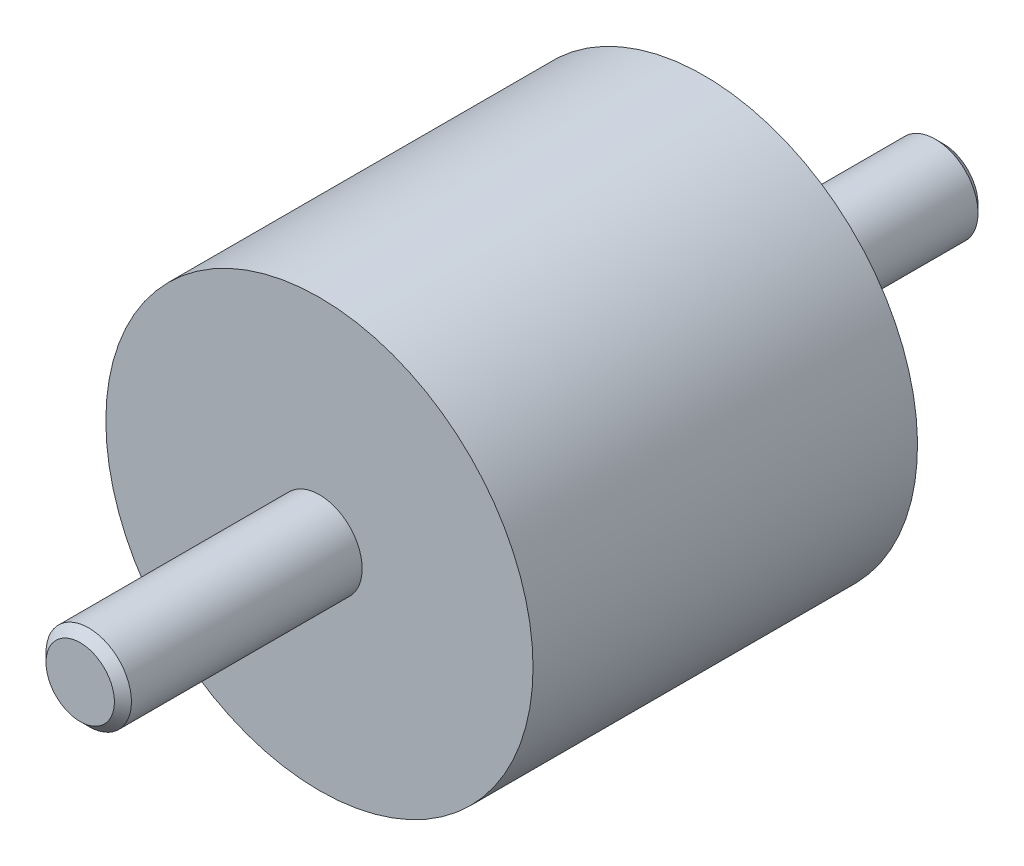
ISO-10303-21;
HEADER;
FILE_DESCRIPTION(('STEP AP214'),'2;1');
FILE_NAME('part.step','',(''),(''),'','','');
FILE_SCHEMA(('AUTOMOTIVE_DESIGN { 1 0 10303 214 1 1 1 1 }'));
ENDSEC;
DATA;
#1=APPLICATION_CONTEXT('core data for automotive mechanical design processes');
#2=APPLICATION_PROTOCOL_DEFINITION('international standard','automotive_design',2000,#1);
#3=PRODUCT_CONTEXT('',#1,'mechanical');
#4=PRODUCT('Part','Part','',(#3));
#5=PRODUCT_RELATED_PRODUCT_CATEGORY('part','',(#4));
#6=PRODUCT_DEFINITION_FORMATION('','',#4);
#7=PRODUCT_DEFINITION_CONTEXT('part definition',#1,'design');
#8=PRODUCT_DEFINITION('design','',#6,#7);
#9=PRODUCT_DEFINITION_SHAPE('','',#8);
#10=(LENGTH_UNIT() NAMED_UNIT(*) SI_UNIT(.MILLI.,.METRE.));
#11=(NAMED_UNIT(*) PLANE_ANGLE_UNIT() SI_UNIT($,.RADIAN.));
#12=(NAMED_UNIT(*) SI_UNIT($,.STERADIAN.) SOLID_ANGLE_UNIT());
#13=UNCERTAINTY_MEASURE_WITH_UNIT(LENGTH_MEASURE(1.E-05),#10,'distance_accuracy_value','');
#14=(GEOMETRIC_REPRESENTATION_CONTEXT(3) GLOBAL_UNCERTAINTY_ASSIGNED_CONTEXT((#13)) GLOBAL_UNIT_ASSIGNED_CONTEXT((#10,
#11,#12)) REPRESENTATION_CONTEXT('',''));
#15=CARTESIAN_POINT('',(0.,0.,0.));
#16=DIRECTION('',(0.,0.,1.));
#17=DIRECTION('',(1.,0.,0.));
#18=AXIS2_PLACEMENT_3D('',#15,#16,#17);
#19=CARTESIAN_POINT('',(0.,0.,0.66666666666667));
#20=DIRECTION('',(0.,0.,1.));
#21=DIRECTION('',(0.,-1.,0.));
#22=AXIS2_PLACEMENT_3D('',#19,#20,#21);
#23=CYLINDRICAL_SURFACE('',#22,25.);
#24=CARTESIAN_POINT('',(0.,0.,0.));
#25=DIRECTION('',(0.,0.,1.));
#26=DIRECTION('',(0.,-1.,0.));
#27=AXIS2_PLACEMENT_3D('',#24,#25,#26);
#28=CIRCLE('',#27,25.);
#29=CARTESIAN_POINT('',(0.,-25.,0.));
#30=VERTEX_POINT('',#29);
#31=EDGE_CURVE('E22',#30,#30,#28,.T.);
#32=ORIENTED_EDGE('',*,*,#31,.T.);
#33=EDGE_LOOP('',(#32));
#34=FACE_BOUND('',#33,.T.);
#35=CARTESIAN_POINT('',(0.,0.,45.));
#36=DIRECTION('',(0.,0.,-1.));
#37=DIRECTION('',(-1.,0.,0.));
#38=AXIS2_PLACEMENT_3D('',#35,#36,#37);
#39=CIRCLE('',#38,25.);
#40=CARTESIAN_POINT('',(-25.,0.,45.));
#41=VERTEX_POINT('',#40);
#42=EDGE_CURVE('E34',#41,#41,#39,.T.);
#43=ORIENTED_EDGE('',*,*,#42,.T.);
#44=EDGE_LOOP('',(#43));
#45=FACE_BOUND('',#44,.T.);
#46=ADVANCED_FACE('F12',(#34,#45),#23,.T.);
#47=CARTESIAN_POINT('',(25.,0.,0.));
#48=DIRECTION('',(0.,0.,-1.));
#49=DIRECTION('',(0.,1.,0.));
#50=AXIS2_PLACEMENT_3D('',#47,#48,#49);
#51=PLANE('',#50);
#52=CARTESIAN_POINT('',(0.,0.,0.));
#53=DIRECTION('',(0.,0.,-1.));
#54=DIRECTION('',(0.,1.,0.));
#55=AXIS2_PLACEMENT_3D('',#52,#53,#54);
#56=CIRCLE('',#55,5.);
#57=CARTESIAN_POINT('',(0.,5.,0.));
#58=VERTEX_POINT('',#57);
#59=EDGE_CURVE('E18',#58,#58,#56,.T.);
#60=ORIENTED_EDGE('',*,*,#59,.F.);
#61=EDGE_LOOP('',(#60));
#62=FACE_BOUND('',#61,.T.);
#63=ORIENTED_EDGE('',*,*,#31,.F.);
#64=EDGE_LOOP('',(#63));
#65=FACE_BOUND('',#64,.T.);
#66=ADVANCED_FACE('F57',(#62,#65),#51,.T.);
#67=CARTESIAN_POINT('',(0.,0.,-28.));
#68=DIRECTION('',(0.,0.,1.));
#69=DIRECTION('',(0.,-1.,0.));
#70=AXIS2_PLACEMENT_3D('',#67,#68,#69);
#71=CYLINDRICAL_SURFACE('',#70,5.);
#72=CARTESIAN_POINT('',(0.,0.,-27.08));
#73=DIRECTION('',(0.,0.,1.));
#74=DIRECTION('',(0.,-1.,0.));
#75=AXIS2_PLACEMENT_3D('',#72,#73,#74);
#76=CIRCLE('',#75,5.);
#77=CARTESIAN_POINT('',(0.,-5.,-27.08));
#78=VERTEX_POINT('',#77);
#79=EDGE_CURVE('E26',#78,#78,#76,.T.);
#80=ORIENTED_EDGE('',*,*,#79,.T.);
#81=EDGE_LOOP('',(#80));
#82=FACE_BOUND('',#81,.T.);
#83=ORIENTED_EDGE('',*,*,#59,.T.);
#84=EDGE_LOOP('',(#83));
#85=FACE_BOUND('',#84,.T.);
#86=ADVANCED_FACE('F62',(#82,#85),#71,.T.);
#87=CARTESIAN_POINT('',(0.,0.,-27.08));
#88=DIRECTION('',(0.,0.,1.));
#89=DIRECTION('',(0.,-1.,0.));
#90=AXIS2_PLACEMENT_3D('',#87,#88,#89);
#91=CONICAL_SURFACE('',#90,5.,0.785398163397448);
#92=CARTESIAN_POINT('',(0.,0.,-28.));
#93=DIRECTION('',(0.,0.,1.));
#94=DIRECTION('',(0.,-1.,0.));
#95=AXIS2_PLACEMENT_3D('',#92,#93,#94);
#96=CIRCLE('',#95,4.08);
#97=CARTESIAN_POINT('',(0.,-4.08,-28.));
#98=VERTEX_POINT('',#97);
#99=EDGE_CURVE('E31',#98,#98,#96,.T.);
#100=ORIENTED_EDGE('',*,*,#99,.T.);
#101=EDGE_LOOP('',(#100));
#102=FACE_BOUND('',#101,.T.);
#103=ORIENTED_EDGE('',*,*,#79,.F.);
#104=EDGE_LOOP('',(#103));
#105=FACE_BOUND('',#104,.T.);
#106=ADVANCED_FACE('F78',(#102,#105),#91,.T.);
#107=CARTESIAN_POINT('',(4.08,0.,-28.));
#108=DIRECTION('',(0.,0.,-1.));
#109=DIRECTION('',(0.,1.,0.));
#110=AXIS2_PLACEMENT_3D('',#107,#108,#109);
#111=PLANE('',#110);
#112=ORIENTED_EDGE('',*,*,#99,.F.);
#113=EDGE_LOOP('',(#112));
#114=FACE_BOUND('',#113,.T.);
#115=ADVANCED_FACE('F70',(#114),#111,.T.);
#116=CARTESIAN_POINT('',(0.,25.,45.));
#117=DIRECTION('',(0.,0.,1.));
#118=DIRECTION('',(1.,0.,0.));
#119=AXIS2_PLACEMENT_3D('',#116,#117,#118);
#120=PLANE('',#119);
#121=CARTESIAN_POINT('',(0.,0.,45.));
#122=DIRECTION('',(0.,0.,1.));
#123=DIRECTION('',(1.,0.,0.));
#124=AXIS2_PLACEMENT_3D('',#121,#122,#123);
#125=CIRCLE('',#124,5.);
#126=CARTESIAN_POINT('',(5.,0.,45.));
#127=VERTEX_POINT('',#126);
#128=EDGE_CURVE('E8',#127,#127,#125,.F.);
#129=ORIENTED_EDGE('',*,*,#128,.T.);
#130=EDGE_LOOP('',(#129));
#131=FACE_BOUND('',#130,.T.);
#132=ORIENTED_EDGE('',*,*,#42,.F.);
#133=EDGE_LOOP('',(#132));
#134=FACE_BOUND('',#133,.T.);
#135=ADVANCED_FACE('F68',(#131,#134),#120,.T.);
#136=CARTESIAN_POINT('',(0.,0.,20.));
#137=DIRECTION('',(0.,0.,1.));
#138=DIRECTION('',(0.,-1.,0.));
#139=AXIS2_PLACEMENT_3D('',#136,#137,#138);
#140=CYLINDRICAL_SURFACE('',#139,5.);
#141=ORIENTED_EDGE('',*,*,#128,.F.);
#142=EDGE_LOOP('',(#141));
#143=FACE_BOUND('',#142,.T.);
#144=CARTESIAN_POINT('',(0.,0.,72.0023270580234));
#145=DIRECTION('',(0.,0.,-1.));
#146=DIRECTION('',(-1.,0.,0.));
#147=AXIS2_PLACEMENT_3D('',#144,#145,#146);
#148=CIRCLE('',#147,5.);
#149=CARTESIAN_POINT('',(-5.,0.,72.0023270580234));
#150=VERTEX_POINT('',#149);
#151=EDGE_CURVE('E37',#150,#150,#148,.T.);
#152=ORIENTED_EDGE('',*,*,#151,.T.);
#153=EDGE_LOOP('',(#152));
#154=FACE_BOUND('',#153,.T.);
#155=ADVANCED_FACE('F54',(#143,#154),#140,.T.);
#156=CARTESIAN_POINT('',(0.,0.,72.0023270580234));
#157=DIRECTION('',(0.,0.,-1.));
#158=DIRECTION('',(-1.,0.,0.));
#159=AXIS2_PLACEMENT_3D('',#156,#157,#158);
#160=CONICAL_SURFACE('',#159,5.,0.785398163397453);
#161=CARTESIAN_POINT('',(0.,0.,73.));
#162=DIRECTION('',(0.,0.,-1.));
#163=DIRECTION('',(-1.,0.,0.));
#164=AXIS2_PLACEMENT_3D('',#161,#162,#163);
#165=CIRCLE('',#164,4.00232705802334);
#166=CARTESIAN_POINT('',(-4.00232705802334,0.,73.));
#167=VERTEX_POINT('',#166);
#168=EDGE_CURVE('E40',#167,#167,#165,.T.);
#169=ORIENTED_EDGE('',*,*,#168,.T.);
#170=EDGE_LOOP('',(#169));
#171=FACE_BOUND('',#170,.T.);
#172=ORIENTED_EDGE('',*,*,#151,.F.);
#173=EDGE_LOOP('',(#172));
#174=FACE_BOUND('',#173,.T.);
#175=ADVANCED_FACE('F44',(#171,#174),#160,.T.);
#176=CARTESIAN_POINT('',(0.,4.00232705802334,73.));
#177=DIRECTION('',(0.,0.,1.));
#178=DIRECTION('',(1.,0.,0.));
#179=AXIS2_PLACEMENT_3D('',#176,#177,#178);
#180=PLANE('',#179);
#181=ORIENTED_EDGE('',*,*,#168,.F.);
#182=EDGE_LOOP('',(#181));
#183=FACE_BOUND('',#182,.T.);
#184=ADVANCED_FACE('F47',(#183),#180,.T.);
#185=CLOSED_SHELL('',(#46,#66,#86,#106,#115,#135,#155,#175,#184));
#186=MANIFOLD_SOLID_BREP('B1',#185);
#187=ADVANCED_BREP_SHAPE_REPRESENTATION('',(#18,#186),#14);
#188=SHAPE_DEFINITION_REPRESENTATION(#9,#187);
ENDSEC;
END-ISO-10303-21;
